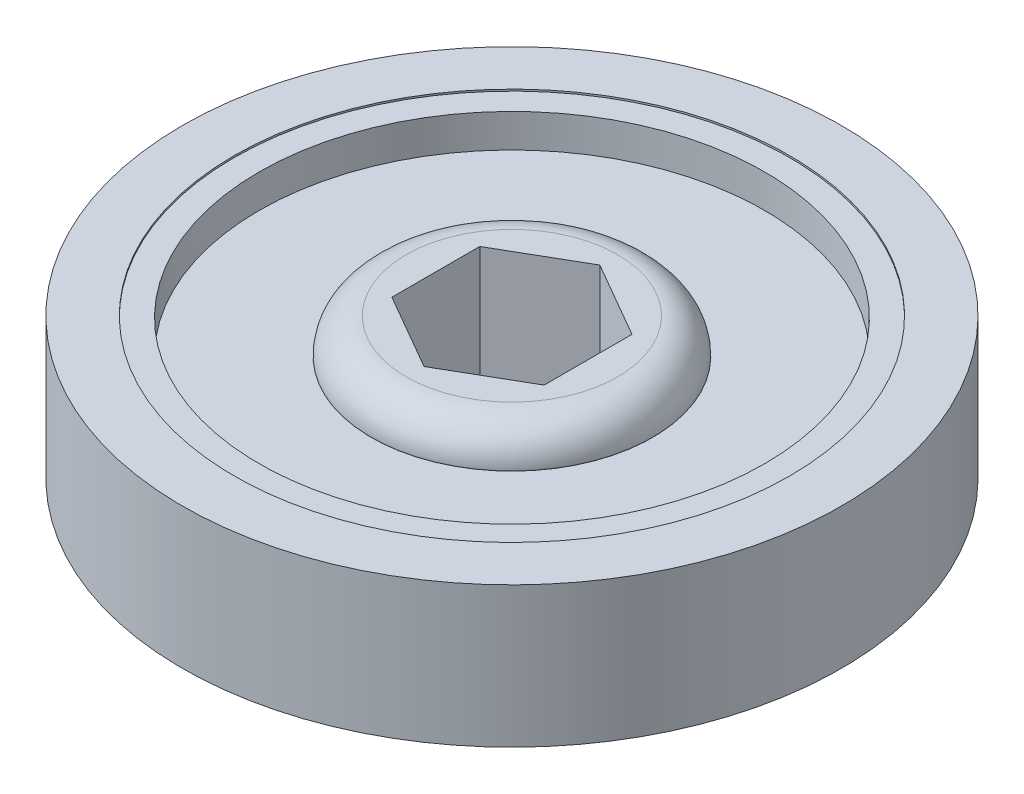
ISO-10303-21;
HEADER;
FILE_DESCRIPTION(('STEP AP214'),'2;1');
FILE_NAME('part.step','',(''),(''),'','','');
FILE_SCHEMA(('AUTOMOTIVE_DESIGN { 1 0 10303 214 1 1 1 1 }'));
ENDSEC;
DATA;
#1=APPLICATION_CONTEXT('core data for automotive mechanical design processes');
#2=APPLICATION_PROTOCOL_DEFINITION('international standard','automotive_design',2000,#1);
#3=PRODUCT_CONTEXT('',#1,'mechanical');
#4=PRODUCT('Part','Part','',(#3));
#5=PRODUCT_RELATED_PRODUCT_CATEGORY('part','',(#4));
#6=PRODUCT_DEFINITION_FORMATION('','',#4);
#7=PRODUCT_DEFINITION_CONTEXT('part definition',#1,'design');
#8=PRODUCT_DEFINITION('design','',#6,#7);
#9=PRODUCT_DEFINITION_SHAPE('','',#8);
#10=(LENGTH_UNIT() NAMED_UNIT(*) SI_UNIT(.MILLI.,.METRE.));
#11=(NAMED_UNIT(*) PLANE_ANGLE_UNIT() SI_UNIT($,.RADIAN.));
#12=(NAMED_UNIT(*) SI_UNIT($,.STERADIAN.) SOLID_ANGLE_UNIT());
#13=UNCERTAINTY_MEASURE_WITH_UNIT(LENGTH_MEASURE(1.E-05),#10,'distance_accuracy_value','');
#14=(GEOMETRIC_REPRESENTATION_CONTEXT(3) GLOBAL_UNCERTAINTY_ASSIGNED_CONTEXT((#13)) GLOBAL_UNIT_ASSIGNED_CONTEXT((#10,
#11,#12)) REPRESENTATION_CONTEXT('',''));
#15=CARTESIAN_POINT('',(0.,0.,0.));
#16=DIRECTION('',(0.,0.,1.));
#17=DIRECTION('',(1.,0.,0.));
#18=AXIS2_PLACEMENT_3D('',#15,#16,#17);
#19=CARTESIAN_POINT('',(0.,-10.16,0.));
#20=DIRECTION('',(0.,1.,0.));
#21=DIRECTION('',(-1.,0.,0.));
#22=AXIS2_PLACEMENT_3D('',#19,#20,#21);
#23=PLANE('',#22);
#24=DIRECTION('',(0.,0.,-1.));
#25=VECTOR('',#24,1.);
#26=CARTESIAN_POINT('',(5.49926131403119,-10.16,3.175));
#27=LINE('',#26,#25);
#28=CARTESIAN_POINT('',(5.49926131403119,-10.16,3.175));
#29=VERTEX_POINT('',#28);
#30=CARTESIAN_POINT('',(5.49926131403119,-10.16,-3.175));
#31=VERTEX_POINT('',#30);
#32=EDGE_CURVE('E96',#29,#31,#27,.T.);
#33=ORIENTED_EDGE('',*,*,#32,.T.);
#34=DIRECTION('',(-0.866025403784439,0.,-0.5));
#35=VECTOR('',#34,1.);
#36=CARTESIAN_POINT('',(5.49926131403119,-10.16,-3.175));
#37=LINE('',#36,#35);
#38=CARTESIAN_POINT('',(0.,-10.16,-6.35));
#39=VERTEX_POINT('',#38);
#40=EDGE_CURVE('E90',#31,#39,#37,.T.);
#41=ORIENTED_EDGE('',*,*,#40,.T.);
#42=DIRECTION('',(-0.866025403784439,0.,0.5));
#43=VECTOR('',#42,1.);
#44=CARTESIAN_POINT('',(0.,-10.16,-6.35));
#45=LINE('',#44,#43);
#46=CARTESIAN_POINT('',(-5.49926131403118,-10.16,-3.175));
#47=VERTEX_POINT('',#46);
#48=EDGE_CURVE('E99',#39,#47,#45,.T.);
#49=ORIENTED_EDGE('',*,*,#48,.T.);
#50=DIRECTION('',(0.,0.,1.));
#51=VECTOR('',#50,1.);
#52=CARTESIAN_POINT('',(-5.49926131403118,-10.16,-3.175));
#53=LINE('',#52,#51);
#54=CARTESIAN_POINT('',(-5.49926131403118,-10.16,3.175));
#55=VERTEX_POINT('',#54);
#56=EDGE_CURVE('E50',#47,#55,#53,.T.);
#57=ORIENTED_EDGE('',*,*,#56,.T.);
#58=DIRECTION('',(0.866025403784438,0.,0.5));
#59=VECTOR('',#58,1.);
#60=CARTESIAN_POINT('',(-5.49926131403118,-10.16,3.175));
#61=LINE('',#60,#59);
#62=CARTESIAN_POINT('',(0.,-10.16,6.35));
#63=VERTEX_POINT('',#62);
#64=EDGE_CURVE('E113',#55,#63,#61,.T.);
#65=ORIENTED_EDGE('',*,*,#64,.T.);
#66=DIRECTION('',(0.866025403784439,0.,-0.5));
#67=VECTOR('',#66,1.);
#68=CARTESIAN_POINT('',(0.,-10.16,6.35));
#69=LINE('',#68,#67);
#70=EDGE_CURVE('E116',#63,#29,#69,.T.);
#71=ORIENTED_EDGE('',*,*,#70,.T.);
#72=EDGE_LOOP('',(#33,#41,#49,#57,#65,#71));
#73=FACE_BOUND('',#72,.T.);
#74=CARTESIAN_POINT('',(0.,-10.16,0.));
#75=DIRECTION('',(0.,1.,0.));
#76=DIRECTION('',(-1.,0.,0.));
#77=AXIS2_PLACEMENT_3D('',#74,#75,#76);
#78=CIRCLE('',#77,7.6454);
#79=CARTESIAN_POINT('',(-7.6454,-10.16,0.));
#80=VERTEX_POINT('',#79);
#81=EDGE_CURVE('E11',#80,#80,#78,.T.);
#82=ORIENTED_EDGE('',*,*,#81,.F.);
#83=EDGE_LOOP('',(#82));
#84=FACE_BOUND('',#83,.T.);
#85=ADVANCED_FACE('F36',(#73,#84),#23,.F.);
#86=CARTESIAN_POINT('',(0.,-7.6454,0.));
#87=DIRECTION('',(0.,1.,0.));
#88=DIRECTION('',(-1.,0.,0.));
#89=AXIS2_PLACEMENT_3D('',#86,#87,#88);
#90=TOROIDAL_SURFACE('',#89,7.6454,2.5146);
#91=CARTESIAN_POINT('',(0.,-7.6454,0.));
#92=DIRECTION('',(0.,1.,0.));
#93=DIRECTION('',(-1.,0.,0.));
#94=AXIS2_PLACEMENT_3D('',#91,#92,#93);
#95=CIRCLE('',#94,10.16);
#96=CARTESIAN_POINT('',(-10.16,-7.6454,0.));
#97=VERTEX_POINT('',#96);
#98=EDGE_CURVE('E43',#97,#97,#95,.T.);
#99=ORIENTED_EDGE('',*,*,#98,.F.);
#100=EDGE_LOOP('',(#99));
#101=FACE_BOUND('',#100,.T.);
#102=ORIENTED_EDGE('',*,*,#81,.T.);
#103=EDGE_LOOP('',(#102));
#104=FACE_BOUND('',#103,.T.);
#105=ADVANCED_FACE('F185',(#101,#104),#90,.T.);
#106=CARTESIAN_POINT('',(0.,0.,0.));
#107=DIRECTION('',(0.,1.,0.));
#108=DIRECTION('',(-1.,0.,0.));
#109=AXIS2_PLACEMENT_3D('',#106,#107,#108);
#110=CYLINDRICAL_SURFACE('',#109,10.16);
#111=CARTESIAN_POINT('',(0.,-7.62,0.));
#112=DIRECTION('',(0.,1.,0.));
#113=DIRECTION('',(-1.,0.,0.));
#114=AXIS2_PLACEMENT_3D('',#111,#112,#113);
#115=CIRCLE('',#114,10.16);
#116=CARTESIAN_POINT('',(-10.16,-7.62,0.));
#117=VERTEX_POINT('',#116);
#118=EDGE_CURVE('E178',#117,#117,#115,.T.);
#119=ORIENTED_EDGE('',*,*,#118,.F.);
#120=EDGE_LOOP('',(#119));
#121=FACE_BOUND('',#120,.T.);
#122=ORIENTED_EDGE('',*,*,#98,.T.);
#123=EDGE_LOOP('',(#122));
#124=FACE_BOUND('',#123,.T.);
#125=ADVANCED_FACE('F183',(#121,#124),#110,.T.);
#126=CARTESIAN_POINT('',(10.16,-7.62,0.));
#127=DIRECTION('',(0.,1.,0.));
#128=DIRECTION('',(-1.,0.,0.));
#129=AXIS2_PLACEMENT_3D('',#126,#127,#128);
#130=PLANE('',#129);
#131=CARTESIAN_POINT('',(0.,-7.62,0.));
#132=DIRECTION('',(0.,1.,0.));
#133=DIRECTION('',(-1.,0.,0.));
#134=AXIS2_PLACEMENT_3D('',#131,#132,#133);
#135=CIRCLE('',#134,18.2627859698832);
#136=CARTESIAN_POINT('',(-18.2627859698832,-7.62000000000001,0.));
#137=VERTEX_POINT('',#136);
#138=EDGE_CURVE('E175',#137,#137,#135,.T.);
#139=ORIENTED_EDGE('',*,*,#138,.F.);
#140=EDGE_LOOP('',(#139));
#141=FACE_BOUND('',#140,.T.);
#142=ORIENTED_EDGE('',*,*,#118,.T.);
#143=EDGE_LOOP('',(#142));
#144=FACE_BOUND('',#143,.T.);
#145=ADVANCED_FACE('F204',(#141,#144),#130,.F.);
#146=CARTESIAN_POINT('',(0.,0.,0.));
#147=DIRECTION('',(0.,1.,0.));
#148=DIRECTION('',(-1.,0.,0.));
#149=AXIS2_PLACEMENT_3D('',#146,#147,#148);
#150=CYLINDRICAL_SURFACE('',#149,18.2627859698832);
#151=CARTESIAN_POINT('',(0.,-10.033,0.));
#152=DIRECTION('',(0.,1.,0.));
#153=DIRECTION('',(-1.,0.,0.));
#154=AXIS2_PLACEMENT_3D('',#151,#152,#153);
#155=CIRCLE('',#154,18.2627859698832);
#156=CARTESIAN_POINT('',(-18.2627859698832,-10.033,0.));
#157=VERTEX_POINT('',#156);
#158=EDGE_CURVE('E172',#157,#157,#155,.T.);
#159=ORIENTED_EDGE('',*,*,#158,.F.);
#160=EDGE_LOOP('',(#159));
#161=FACE_BOUND('',#160,.T.);
#162=ORIENTED_EDGE('',*,*,#138,.T.);
#163=EDGE_LOOP('',(#162));
#164=FACE_BOUND('',#163,.T.);
#165=ADVANCED_FACE('F212',(#161,#164),#150,.F.);
#166=CARTESIAN_POINT('',(18.2627859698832,-10.033,0.));
#167=DIRECTION('',(0.,1.,0.));
#168=DIRECTION('',(-1.,0.,0.));
#169=AXIS2_PLACEMENT_3D('',#166,#167,#168);
#170=PLANE('',#169);
#171=CARTESIAN_POINT('',(0.,-10.033,0.));
#172=DIRECTION('',(0.,1.,0.));
#173=DIRECTION('',(-1.,0.,0.));
#174=AXIS2_PLACEMENT_3D('',#171,#172,#173);
#175=CIRCLE('',#174,20.0608737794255);
#176=CARTESIAN_POINT('',(-20.0608737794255,-10.033,0.));
#177=VERTEX_POINT('',#176);
#178=EDGE_CURVE('E169',#177,#177,#175,.T.);
#179=ORIENTED_EDGE('',*,*,#178,.F.);
#180=EDGE_LOOP('',(#179));
#181=FACE_BOUND('',#180,.T.);
#182=ORIENTED_EDGE('',*,*,#158,.T.);
#183=EDGE_LOOP('',(#182));
#184=FACE_BOUND('',#183,.T.);
#185=ADVANCED_FACE('F220',(#181,#184),#170,.F.);
#186=CARTESIAN_POINT('',(0.,0.,0.));
#187=DIRECTION('',(0.,1.,0.));
#188=DIRECTION('',(-1.,0.,0.));
#189=AXIS2_PLACEMENT_3D('',#186,#187,#188);
#190=CYLINDRICAL_SURFACE('',#189,20.0608737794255);
#191=CARTESIAN_POINT('',(0.,-10.16,0.));
#192=DIRECTION('',(0.,1.,0.));
#193=DIRECTION('',(-1.,0.,0.));
#194=AXIS2_PLACEMENT_3D('',#191,#192,#193);
#195=CIRCLE('',#194,20.0608737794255);
#196=CARTESIAN_POINT('',(-20.0608737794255,-10.16,0.));
#197=VERTEX_POINT('',#196);
#198=EDGE_CURVE('E166',#197,#197,#195,.T.);
#199=ORIENTED_EDGE('',*,*,#198,.F.);
#200=EDGE_LOOP('',(#199));
#201=FACE_BOUND('',#200,.T.);
#202=ORIENTED_EDGE('',*,*,#178,.T.);
#203=EDGE_LOOP('',(#202));
#204=FACE_BOUND('',#203,.T.);
#205=ADVANCED_FACE('F228',(#201,#204),#190,.F.);
#206=CARTESIAN_POINT('',(20.0608737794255,-10.16,0.));
#207=DIRECTION('',(0.,1.,0.));
#208=DIRECTION('',(-1.,0.,0.));
#209=AXIS2_PLACEMENT_3D('',#206,#207,#208);
#210=PLANE('',#209);
#211=CARTESIAN_POINT('',(0.,-10.16,0.));
#212=DIRECTION('',(0.,1.,0.));
#213=DIRECTION('',(-1.,0.,0.));
#214=AXIS2_PLACEMENT_3D('',#211,#212,#213);
#215=CIRCLE('',#214,23.8125);
#216=CARTESIAN_POINT('',(-23.8125,-10.16,0.));
#217=VERTEX_POINT('',#216);
#218=EDGE_CURVE('E163',#217,#217,#215,.T.);
#219=ORIENTED_EDGE('',*,*,#218,.F.);
#220=EDGE_LOOP('',(#219));
#221=FACE_BOUND('',#220,.T.);
#222=ORIENTED_EDGE('',*,*,#198,.T.);
#223=EDGE_LOOP('',(#222));
#224=FACE_BOUND('',#223,.T.);
#225=ADVANCED_FACE('F236',(#221,#224),#210,.F.);
#226=CARTESIAN_POINT('',(0.,0.,0.));
#227=DIRECTION('',(0.,1.,0.));
#228=DIRECTION('',(-1.,0.,0.));
#229=AXIS2_PLACEMENT_3D('',#226,#227,#228);
#230=CYLINDRICAL_SURFACE('',#229,23.8125);
#231=CARTESIAN_POINT('',(0.,0.,0.));
#232=DIRECTION('',(0.,1.,0.));
#233=DIRECTION('',(-1.,0.,0.));
#234=AXIS2_PLACEMENT_3D('',#231,#232,#233);
#235=CIRCLE('',#234,23.8125);
#236=CARTESIAN_POINT('',(-23.8125,0.,0.));
#237=VERTEX_POINT('',#236);
#238=EDGE_CURVE('E160',#237,#237,#235,.T.);
#239=ORIENTED_EDGE('',*,*,#238,.F.);
#240=EDGE_LOOP('',(#239));
#241=FACE_BOUND('',#240,.T.);
#242=ORIENTED_EDGE('',*,*,#218,.T.);
#243=EDGE_LOOP('',(#242));
#244=FACE_BOUND('',#243,.T.);
#245=ADVANCED_FACE('F245',(#241,#244),#230,.T.);
#246=CARTESIAN_POINT('',(20.0608737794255,0.,0.));
#247=DIRECTION('',(0.,-1.,0.));
#248=DIRECTION('',(1.,0.,0.));
#249=AXIS2_PLACEMENT_3D('',#246,#247,#248);
#250=PLANE('',#249);
#251=CARTESIAN_POINT('',(0.,0.,0.));
#252=DIRECTION('',(0.,1.,0.));
#253=DIRECTION('',(-1.,0.,0.));
#254=AXIS2_PLACEMENT_3D('',#251,#252,#253);
#255=CIRCLE('',#254,20.0608737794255);
#256=CARTESIAN_POINT('',(-20.0608737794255,0.,0.));
#257=VERTEX_POINT('',#256);
#258=EDGE_CURVE('E157',#257,#257,#255,.T.);
#259=ORIENTED_EDGE('',*,*,#258,.F.);
#260=EDGE_LOOP('',(#259));
#261=FACE_BOUND('',#260,.T.);
#262=ORIENTED_EDGE('',*,*,#238,.T.);
#263=EDGE_LOOP('',(#262));
#264=FACE_BOUND('',#263,.T.);
#265=ADVANCED_FACE('F253',(#261,#264),#250,.F.);
#266=CARTESIAN_POINT('',(0.,0.,0.));
#267=DIRECTION('',(0.,1.,0.));
#268=DIRECTION('',(-1.,0.,0.));
#269=AXIS2_PLACEMENT_3D('',#266,#267,#268);
#270=CYLINDRICAL_SURFACE('',#269,20.0608737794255);
#271=CARTESIAN_POINT('',(0.,-0.127000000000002,0.));
#272=DIRECTION('',(0.,1.,0.));
#273=DIRECTION('',(-1.,0.,0.));
#274=AXIS2_PLACEMENT_3D('',#271,#272,#273);
#275=CIRCLE('',#274,20.0608737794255);
#276=CARTESIAN_POINT('',(-20.0608737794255,-0.127000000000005,0.));
#277=VERTEX_POINT('',#276);
#278=EDGE_CURVE('E154',#277,#277,#275,.T.);
#279=ORIENTED_EDGE('',*,*,#278,.F.);
#280=EDGE_LOOP('',(#279));
#281=FACE_BOUND('',#280,.T.);
#282=ORIENTED_EDGE('',*,*,#258,.T.);
#283=EDGE_LOOP('',(#282));
#284=FACE_BOUND('',#283,.T.);
#285=ADVANCED_FACE('F260',(#281,#284),#270,.F.);
#286=CARTESIAN_POINT('',(18.2627859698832,-0.127,0.));
#287=DIRECTION('',(0.,-1.,0.));
#288=DIRECTION('',(1.,0.,0.));
#289=AXIS2_PLACEMENT_3D('',#286,#287,#288);
#290=PLANE('',#289);
#291=CARTESIAN_POINT('',(0.,-0.127000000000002,0.));
#292=DIRECTION('',(0.,1.,0.));
#293=DIRECTION('',(-1.,0.,0.));
#294=AXIS2_PLACEMENT_3D('',#291,#292,#293);
#295=CIRCLE('',#294,18.2627859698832);
#296=CARTESIAN_POINT('',(-18.2627859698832,-0.127000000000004,0.));
#297=VERTEX_POINT('',#296);
#298=EDGE_CURVE('E151',#297,#297,#295,.T.);
#299=ORIENTED_EDGE('',*,*,#298,.F.);
#300=EDGE_LOOP('',(#299));
#301=FACE_BOUND('',#300,.T.);
#302=ORIENTED_EDGE('',*,*,#278,.T.);
#303=EDGE_LOOP('',(#302));
#304=FACE_BOUND('',#303,.T.);
#305=ADVANCED_FACE('F268',(#301,#304),#290,.F.);
#306=CARTESIAN_POINT('',(0.,0.,0.));
#307=DIRECTION('',(0.,1.,0.));
#308=DIRECTION('',(-1.,0.,0.));
#309=AXIS2_PLACEMENT_3D('',#306,#307,#308);
#310=CYLINDRICAL_SURFACE('',#309,18.2627859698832);
#311=CARTESIAN_POINT('',(0.,-2.54,0.));
#312=DIRECTION('',(0.,1.,0.));
#313=DIRECTION('',(-1.,0.,0.));
#314=AXIS2_PLACEMENT_3D('',#311,#312,#313);
#315=CIRCLE('',#314,18.2627859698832);
#316=CARTESIAN_POINT('',(-18.2627859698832,-2.54,0.));
#317=VERTEX_POINT('',#316);
#318=EDGE_CURVE('E148',#317,#317,#315,.T.);
#319=ORIENTED_EDGE('',*,*,#318,.F.);
#320=EDGE_LOOP('',(#319));
#321=FACE_BOUND('',#320,.T.);
#322=ORIENTED_EDGE('',*,*,#298,.T.);
#323=EDGE_LOOP('',(#322));
#324=FACE_BOUND('',#323,.T.);
#325=ADVANCED_FACE('F276',(#321,#324),#310,.F.);
#326=CARTESIAN_POINT('',(10.16,-2.54,0.));
#327=DIRECTION('',(0.,-1.,0.));
#328=DIRECTION('',(1.,0.,0.));
#329=AXIS2_PLACEMENT_3D('',#326,#327,#328);
#330=PLANE('',#329);
#331=CARTESIAN_POINT('',(0.,-2.54,0.));
#332=DIRECTION('',(0.,1.,0.));
#333=DIRECTION('',(-1.,0.,0.));
#334=AXIS2_PLACEMENT_3D('',#331,#332,#333);
#335=CIRCLE('',#334,10.16);
#336=CARTESIAN_POINT('',(-10.16,-2.54,0.));
#337=VERTEX_POINT('',#336);
#338=EDGE_CURVE('E145',#337,#337,#335,.T.);
#339=ORIENTED_EDGE('',*,*,#338,.F.);
#340=EDGE_LOOP('',(#339));
#341=FACE_BOUND('',#340,.T.);
#342=ORIENTED_EDGE('',*,*,#318,.T.);
#343=EDGE_LOOP('',(#342));
#344=FACE_BOUND('',#343,.T.);
#345=ADVANCED_FACE('F284',(#341,#344),#330,.F.);
#346=CARTESIAN_POINT('',(0.,0.,0.));
#347=DIRECTION('',(0.,1.,0.));
#348=DIRECTION('',(-1.,0.,0.));
#349=AXIS2_PLACEMENT_3D('',#346,#347,#348);
#350=CYLINDRICAL_SURFACE('',#349,10.16);
#351=CARTESIAN_POINT('',(0.,-2.5146,0.));
#352=DIRECTION('',(0.,1.,0.));
#353=DIRECTION('',(-1.,0.,0.));
#354=AXIS2_PLACEMENT_3D('',#351,#352,#353);
#355=CIRCLE('',#354,10.16);
#356=CARTESIAN_POINT('',(-10.16,-2.5146,0.));
#357=VERTEX_POINT('',#356);
#358=EDGE_CURVE('E142',#357,#357,#355,.T.);
#359=ORIENTED_EDGE('',*,*,#358,.F.);
#360=EDGE_LOOP('',(#359));
#361=FACE_BOUND('',#360,.T.);
#362=ORIENTED_EDGE('',*,*,#338,.T.);
#363=EDGE_LOOP('',(#362));
#364=FACE_BOUND('',#363,.T.);
#365=ADVANCED_FACE('F292',(#361,#364),#350,.T.);
#366=CARTESIAN_POINT('',(0.,-2.5146,0.));
#367=DIRECTION('',(0.,1.,0.));
#368=DIRECTION('',(-1.,0.,0.));
#369=AXIS2_PLACEMENT_3D('',#366,#367,#368);
#370=TOROIDAL_SURFACE('',#369,7.6454,2.5146);
#371=CARTESIAN_POINT('',(0.,0.,0.));
#372=DIRECTION('',(0.,1.,0.));
#373=DIRECTION('',(-1.,0.,0.));
#374=AXIS2_PLACEMENT_3D('',#371,#372,#373);
#375=CIRCLE('',#374,7.6454);
#376=CARTESIAN_POINT('',(-7.6454,0.,0.));
#377=VERTEX_POINT('',#376);
#378=EDGE_CURVE('E132',#377,#377,#375,.T.);
#379=ORIENTED_EDGE('',*,*,#378,.F.);
#380=EDGE_LOOP('',(#379));
#381=FACE_BOUND('',#380,.T.);
#382=ORIENTED_EDGE('',*,*,#358,.T.);
#383=EDGE_LOOP('',(#382));
#384=FACE_BOUND('',#383,.T.);
#385=ADVANCED_FACE('F300',(#381,#384),#370,.T.);
#386=CARTESIAN_POINT('',(0.,0.,0.));
#387=DIRECTION('',(0.,-1.,0.));
#388=DIRECTION('',(1.,0.,0.));
#389=AXIS2_PLACEMENT_3D('',#386,#387,#388);
#390=PLANE('',#389);
#391=DIRECTION('',(-0.866025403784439,0.,0.5));
#392=VECTOR('',#391,1.);
#393=CARTESIAN_POINT('',(0.,0.,-6.35));
#394=LINE('',#393,#392);
#395=CARTESIAN_POINT('',(0.,0.,-6.35));
#396=VERTEX_POINT('',#395);
#397=CARTESIAN_POINT('',(-5.49926131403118,0.,-3.175));
#398=VERTEX_POINT('',#397);
#399=EDGE_CURVE('E120',#396,#398,#394,.T.);
#400=ORIENTED_EDGE('',*,*,#399,.F.);
#401=DIRECTION('',(-0.866025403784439,0.,-0.5));
#402=VECTOR('',#401,1.);
#403=CARTESIAN_POINT('',(5.49926131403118,0.,-3.175));
#404=LINE('',#403,#402);
#405=CARTESIAN_POINT('',(5.49926131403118,0.,-3.175));
#406=VERTEX_POINT('',#405);
#407=EDGE_CURVE('E58',#406,#396,#404,.T.);
#408=ORIENTED_EDGE('',*,*,#407,.F.);
#409=DIRECTION('',(0.,0.,-1.));
#410=VECTOR('',#409,1.);
#411=CARTESIAN_POINT('',(5.49926131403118,0.,3.175));
#412=LINE('',#411,#410);
#413=CARTESIAN_POINT('',(5.49926131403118,0.,3.175));
#414=VERTEX_POINT('',#413);
#415=EDGE_CURVE('E106',#414,#406,#412,.T.);
#416=ORIENTED_EDGE('',*,*,#415,.F.);
#417=DIRECTION('',(0.866025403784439,0.,-0.5));
#418=VECTOR('',#417,1.);
#419=CARTESIAN_POINT('',(0.,0.,6.35));
#420=LINE('',#419,#418);
#421=CARTESIAN_POINT('',(0.,0.,6.35));
#422=VERTEX_POINT('',#421);
#423=EDGE_CURVE('E109',#422,#414,#420,.T.);
#424=ORIENTED_EDGE('',*,*,#423,.F.);
#425=DIRECTION('',(0.866025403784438,0.,0.5));
#426=VECTOR('',#425,1.);
#427=CARTESIAN_POINT('',(-5.49926131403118,0.,3.175));
#428=LINE('',#427,#426);
#429=CARTESIAN_POINT('',(-5.49926131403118,0.,3.175));
#430=VERTEX_POINT('',#429);
#431=EDGE_CURVE('E125',#430,#422,#428,.T.);
#432=ORIENTED_EDGE('',*,*,#431,.F.);
#433=DIRECTION('',(0.,0.,1.));
#434=VECTOR('',#433,1.);
#435=CARTESIAN_POINT('',(-5.49926131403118,0.,-3.175));
#436=LINE('',#435,#434);
#437=EDGE_CURVE('E122',#398,#430,#436,.T.);
#438=ORIENTED_EDGE('',*,*,#437,.F.);
#439=EDGE_LOOP('',(#400,#408,#416,#424,#432,#438));
#440=FACE_BOUND('',#439,.T.);
#441=ORIENTED_EDGE('',*,*,#378,.T.);
#442=EDGE_LOOP('',(#441));
#443=FACE_BOUND('',#442,.T.);
#444=ADVANCED_FACE('F307',(#440,#443),#390,.F.);
#445=CARTESIAN_POINT('',(5.49926131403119,-10.16,-3.175));
#446=DIRECTION('',(0.5,0.,-0.866025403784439));
#447=DIRECTION('',(-0.866025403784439,0.,-0.5));
#448=AXIS2_PLACEMENT_3D('',#445,#446,#447);
#449=PLANE('',#448);
#450=ORIENTED_EDGE('',*,*,#407,.T.);
#451=DIRECTION('',(0.,1.,0.));
#452=VECTOR('',#451,1.);
#453=CARTESIAN_POINT('',(0.,-10.16,-6.35));
#454=LINE('',#453,#452);
#455=EDGE_CURVE('E86',#39,#396,#454,.T.);
#456=ORIENTED_EDGE('',*,*,#455,.F.);
#457=ORIENTED_EDGE('',*,*,#40,.F.);
#458=DIRECTION('',(0.,1.,0.));
#459=VECTOR('',#458,1.);
#460=CARTESIAN_POINT('',(5.49926131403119,-10.16,-3.175));
#461=LINE('',#460,#459);
#462=EDGE_CURVE('E130',#31,#406,#461,.T.);
#463=ORIENTED_EDGE('',*,*,#462,.T.);
#464=EDGE_LOOP('',(#450,#456,#457,#463));
#465=FACE_BOUND('',#464,.T.);
#466=ADVANCED_FACE('F88',(#465),#449,.F.);
#467=CARTESIAN_POINT('',(5.49926131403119,-10.16,3.175));
#468=DIRECTION('',(1.,0.,0.));
#469=DIRECTION('',(0.,1.,0.));
#470=AXIS2_PLACEMENT_3D('',#467,#468,#469);
#471=PLANE('',#470);
#472=ORIENTED_EDGE('',*,*,#415,.T.);
#473=ORIENTED_EDGE('',*,*,#462,.F.);
#474=ORIENTED_EDGE('',*,*,#32,.F.);
#475=DIRECTION('',(0.,1.,0.));
#476=VECTOR('',#475,1.);
#477=CARTESIAN_POINT('',(5.49926131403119,-10.16,3.175));
#478=LINE('',#477,#476);
#479=EDGE_CURVE('E133',#29,#414,#478,.T.);
#480=ORIENTED_EDGE('',*,*,#479,.T.);
#481=EDGE_LOOP('',(#472,#473,#474,#480));
#482=FACE_BOUND('',#481,.T.);
#483=ADVANCED_FACE('F321',(#482),#471,.F.);
#484=CARTESIAN_POINT('',(0.,-10.16,6.35));
#485=DIRECTION('',(0.5,0.,0.866025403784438));
#486=DIRECTION('',(0.866025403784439,0.,-0.5));
#487=AXIS2_PLACEMENT_3D('',#484,#485,#486);
#488=PLANE('',#487);
#489=ORIENTED_EDGE('',*,*,#423,.T.);
#490=ORIENTED_EDGE('',*,*,#479,.F.);
#491=ORIENTED_EDGE('',*,*,#70,.F.);
#492=DIRECTION('',(0.,1.,0.));
#493=VECTOR('',#492,1.);
#494=CARTESIAN_POINT('',(0.,-10.16,6.35));
#495=LINE('',#494,#493);
#496=EDGE_CURVE('E135',#63,#422,#495,.T.);
#497=ORIENTED_EDGE('',*,*,#496,.T.);
#498=EDGE_LOOP('',(#489,#490,#491,#497));
#499=FACE_BOUND('',#498,.T.);
#500=ADVANCED_FACE('F328',(#499),#488,.F.);
#501=CARTESIAN_POINT('',(-5.49926131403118,-10.16,3.175));
#502=DIRECTION('',(-0.5,0.,0.866025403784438));
#503=DIRECTION('',(0.866025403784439,0.,0.5));
#504=AXIS2_PLACEMENT_3D('',#501,#502,#503);
#505=PLANE('',#504);
#506=ORIENTED_EDGE('',*,*,#431,.T.);
#507=ORIENTED_EDGE('',*,*,#496,.F.);
#508=ORIENTED_EDGE('',*,*,#64,.F.);
#509=DIRECTION('',(0.,1.,0.));
#510=VECTOR('',#509,1.);
#511=CARTESIAN_POINT('',(-5.49926131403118,-10.16,3.175));
#512=LINE('',#511,#510);
#513=EDGE_CURVE('E137',#55,#430,#512,.T.);
#514=ORIENTED_EDGE('',*,*,#513,.T.);
#515=EDGE_LOOP('',(#506,#507,#508,#514));
#516=FACE_BOUND('',#515,.T.);
#517=ADVANCED_FACE('F336',(#516),#505,.F.);
#518=CARTESIAN_POINT('',(-5.49926131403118,-10.16,-3.175));
#519=DIRECTION('',(-1.,0.,0.));
#520=DIRECTION('',(0.,0.,1.));
#521=AXIS2_PLACEMENT_3D('',#518,#519,#520);
#522=PLANE('',#521);
#523=ORIENTED_EDGE('',*,*,#437,.T.);
#524=ORIENTED_EDGE('',*,*,#513,.F.);
#525=ORIENTED_EDGE('',*,*,#56,.F.);
#526=DIRECTION('',(0.,1.,0.));
#527=VECTOR('',#526,1.);
#528=CARTESIAN_POINT('',(-5.49926131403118,-10.16,-3.175));
#529=LINE('',#528,#527);
#530=EDGE_CURVE('E95',#47,#398,#529,.T.);
#531=ORIENTED_EDGE('',*,*,#530,.T.);
#532=EDGE_LOOP('',(#523,#524,#525,#531));
#533=FACE_BOUND('',#532,.T.);
#534=ADVANCED_FACE('F344',(#533),#522,.F.);
#535=CARTESIAN_POINT('',(0.,-10.16,-6.35));
#536=DIRECTION('',(-0.5,0.,-0.866025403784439));
#537=DIRECTION('',(-0.866025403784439,0.,0.5));
#538=AXIS2_PLACEMENT_3D('',#535,#536,#537);
#539=PLANE('',#538);
#540=ORIENTED_EDGE('',*,*,#399,.T.);
#541=ORIENTED_EDGE('',*,*,#530,.F.);
#542=ORIENTED_EDGE('',*,*,#48,.F.);
#543=ORIENTED_EDGE('',*,*,#455,.T.);
#544=EDGE_LOOP('',(#540,#541,#542,#543));
#545=FACE_BOUND('',#544,.T.);
#546=ADVANCED_FACE('F100',(#545),#539,.F.);
#547=CLOSED_SHELL('',(#85,#105,#125,#145,#165,#185,#205,#225,#245,#265,#285,#305,#325,#345,#365,
#385,#444,#466,#483,#500,#517,#534,#546));
#548=MANIFOLD_SOLID_BREP('B2',#547);
#549=ADVANCED_BREP_SHAPE_REPRESENTATION('',(#18,#548),#14);
#550=SHAPE_DEFINITION_REPRESENTATION(#9,#549);
ENDSEC;
END-ISO-10303-21;
